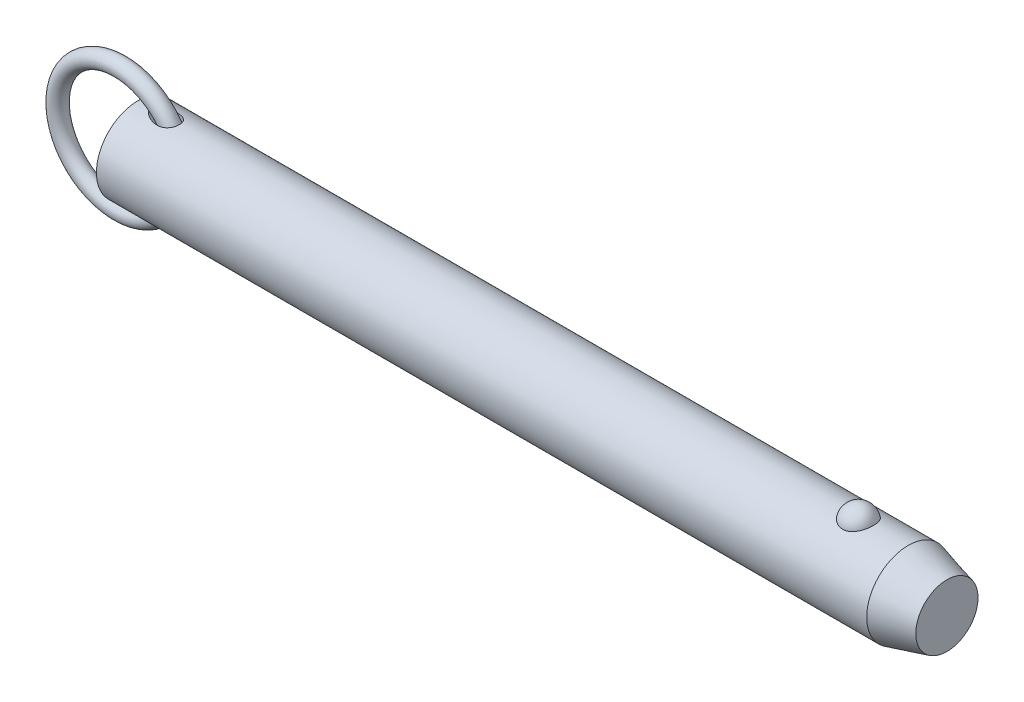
ISO-10303-21;
HEADER;
FILE_DESCRIPTION(('STEP AP214'),'2;1');
FILE_NAME('part.step','',(''),(''),'','','');
FILE_SCHEMA(('AUTOMOTIVE_DESIGN { 1 0 10303 214 1 1 1 1 }'));
ENDSEC;
DATA;
#1=APPLICATION_CONTEXT('core data for automotive mechanical design processes');
#2=APPLICATION_PROTOCOL_DEFINITION('international standard','automotive_design',2000,#1);
#3=PRODUCT_CONTEXT('',#1,'mechanical');
#4=PRODUCT('Part','Part','',(#3));
#5=PRODUCT_RELATED_PRODUCT_CATEGORY('part','',(#4));
#6=PRODUCT_DEFINITION_FORMATION('','',#4);
#7=PRODUCT_DEFINITION_CONTEXT('part definition',#1,'design');
#8=PRODUCT_DEFINITION('design','',#6,#7);
#9=PRODUCT_DEFINITION_SHAPE('','',#8);
#10=(LENGTH_UNIT() NAMED_UNIT(*) SI_UNIT(.MILLI.,.METRE.));
#11=(NAMED_UNIT(*) PLANE_ANGLE_UNIT() SI_UNIT($,.RADIAN.));
#12=(NAMED_UNIT(*) SI_UNIT($,.STERADIAN.) SOLID_ANGLE_UNIT());
#13=UNCERTAINTY_MEASURE_WITH_UNIT(LENGTH_MEASURE(1.E-05),#10,'distance_accuracy_value','');
#14=(GEOMETRIC_REPRESENTATION_CONTEXT(3) GLOBAL_UNCERTAINTY_ASSIGNED_CONTEXT((#13)) GLOBAL_UNIT_ASSIGNED_CONTEXT((#10,
#11,#12)) REPRESENTATION_CONTEXT('',''));
#15=CARTESIAN_POINT('',(0.,0.,0.));
#16=DIRECTION('',(0.,0.,1.));
#17=DIRECTION('',(1.,0.,0.));
#18=AXIS2_PLACEMENT_3D('',#15,#16,#17);
#19=CARTESIAN_POINT('',(-5.53898640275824,0.,0.));
#20=DIRECTION('',(0.,0.,1.));
#21=DIRECTION('',(1.,0.,0.));
#22=AXIS2_PLACEMENT_3D('',#19,#20,#21);
#23=TOROIDAL_SURFACE('',#22,19.05,2.54);
#24=CARTESIAN_POINT('',(16.0510135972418,0.,0.));
#25=VERTEX_POINT('',#24);
#26=VERTEX_LOOP('',#25);
#27=FACE_BOUND('',#26,.T.);
#28=ADVANCED_FACE('P0_F12',(#27),#23,.T.);
#29=CLOSED_SHELL('',(#28));
#30=MANIFOLD_SOLID_BREP('P0_B1',#29);
#31=CARTESIAN_POINT('',(0.,0.,0.));
#32=DIRECTION('',(1.,0.,0.));
#33=DIRECTION('',(0.,0.,-1.));
#34=AXIS2_PLACEMENT_3D('',#31,#32,#33);
#35=CYLINDRICAL_SURFACE('',#34,12.7);
#36=CARTESIAN_POINT('',(235.800738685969,0.,0.));
#37=DIRECTION('',(1.,0.,0.));
#38=DIRECTION('',(0.,0.,-1.));
#39=AXIS2_PLACEMENT_3D('',#36,#37,#38);
#40=CIRCLE('',#39,12.7);
#41=CARTESIAN_POINT('',(235.800738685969,0.,-12.7));
#42=VERTEX_POINT('',#41);
#43=EDGE_CURVE('P1_E89',#42,#42,#40,.T.);
#44=ORIENTED_EDGE('',*,*,#43,.F.);
#45=EDGE_LOOP('',(#44));
#46=FACE_BOUND('',#45,.T.);
#47=CARTESIAN_POINT('',(0.,0.,0.));
#48=DIRECTION('',(1.,0.,0.));
#49=DIRECTION('',(0.,0.,-1.));
#50=AXIS2_PLACEMENT_3D('',#47,#48,#49);
#51=CIRCLE('',#50,12.7);
#52=CARTESIAN_POINT('',(0.,0.,-12.7));
#53=VERTEX_POINT('',#52);
#54=EDGE_CURVE('P1_E52',#53,#53,#51,.T.);
#55=ORIENTED_EDGE('',*,*,#54,.T.);
#56=EDGE_LOOP('',(#55));
#57=FACE_BOUND('',#56,.T.);
#58=CARTESIAN_POINT('',(220.560042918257,11.7500437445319,4.81938502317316));
#59=CARTESIAN_POINT('',(220.435088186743,11.7500430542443,4.81938571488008));
#60=CARTESIAN_POINT('',(220.310144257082,11.7520975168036,4.81438658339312));
#61=CARTESIAN_POINT('',(220.061142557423,11.760253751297,4.79442904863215));
#62=CARTESIAN_POINT('',(219.937085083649,11.7663568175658,4.77946746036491));
#63=CARTESIAN_POINT('',(219.690901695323,11.7824262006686,4.73971414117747));
#64=CARTESIAN_POINT('',(219.568774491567,11.7923898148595,4.71492928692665));
#65=CARTESIAN_POINT('',(219.327187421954,11.8158938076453,4.65571340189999));
#66=CARTESIAN_POINT('',(219.20772859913,11.8294355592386,4.62127866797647));
#67=CARTESIAN_POINT('',(218.972557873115,11.8596812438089,4.54309502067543));
#68=CARTESIAN_POINT('',(218.856839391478,11.8763792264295,4.49936361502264));
#69=CARTESIAN_POINT('',(218.629653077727,11.9124878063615,4.40287235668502));
#70=CARTESIAN_POINT('',(218.518186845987,11.9318994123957,4.35010914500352));
#71=CARTESIAN_POINT('',(218.191278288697,11.9934256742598,4.1788131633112));
#72=CARTESIAN_POINT('',(217.983127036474,12.038858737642,4.04720756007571));
#73=CARTESIAN_POINT('',(217.585850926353,12.1352173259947,3.74856446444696));
#74=CARTESIAN_POINT('',(217.397443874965,12.1862630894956,3.5806182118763));
#75=CARTESIAN_POINT('',(217.050521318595,12.2875163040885,3.2160075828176));
#76=CARTESIAN_POINT('',(216.892011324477,12.3377235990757,3.01933792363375));
#77=CARTESIAN_POINT('',(216.60168878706,12.4344923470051,2.59291655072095));
#78=CARTESIAN_POINT('',(216.471376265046,12.4807925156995,2.36208286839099));
#79=CARTESIAN_POINT('',(216.249407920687,12.5623454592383,1.88070399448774));
#80=CARTESIAN_POINT('',(216.157755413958,12.5975972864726,1.63015711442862));
#81=CARTESIAN_POINT('',(216.014046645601,12.6538414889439,1.11298869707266));
#82=CARTESIAN_POINT('',(215.962499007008,12.6746503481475,0.846205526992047));
#83=CARTESIAN_POINT('',(215.901977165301,12.699153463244,0.307085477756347));
#84=CARTESIAN_POINT('',(215.893001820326,12.7028481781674,0.0347487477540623));
#85=CARTESIAN_POINT('',(215.917731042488,12.6927785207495,-0.506073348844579));
#86=CARTESIAN_POINT('',(215.951189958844,12.6791146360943,-0.774571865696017));
#87=CARTESIAN_POINT('',(216.059687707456,12.635882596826,-1.30170246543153));
#88=CARTESIAN_POINT('',(216.13472729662,12.606314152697,-1.56033436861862));
#89=CARTESIAN_POINT('',(216.325000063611,12.5342328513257,-2.06083899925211));
#90=CARTESIAN_POINT('',(216.440287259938,12.4917026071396,-2.30268867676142));
#91=CARTESIAN_POINT('',(216.708704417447,12.3981123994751,-2.76259600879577));
#92=CARTESIAN_POINT('',(216.861837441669,12.3470517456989,-2.98065173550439));
#93=CARTESIAN_POINT('',(217.203507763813,12.2416045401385,-3.38786328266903));
#94=CARTESIAN_POINT('',(217.392201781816,12.1872040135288,-3.57688418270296));
#95=CARTESIAN_POINT('',(217.800239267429,12.0814086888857,-3.91941073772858));
#96=CARTESIAN_POINT('',(218.019580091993,12.0300136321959,-4.07291945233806));
#97=CARTESIAN_POINT('',(218.478375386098,11.9373542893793,-4.33691289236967));
#98=CARTESIAN_POINT('',(218.717304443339,11.8958982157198,-4.44824125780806));
#99=CARTESIAN_POINT('',(219.21243761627,11.8268116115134,-4.62881985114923));
#100=CARTESIAN_POINT('',(219.468635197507,11.7991758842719,-4.69808589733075));
#101=CARTESIAN_POINT('',(219.977164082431,11.7622209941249,-4.78983181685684));
#102=CARTESIAN_POINT('',(220.229041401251,11.7520502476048,-4.8144902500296));
#103=CARTESIAN_POINT('',(220.733573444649,11.7485796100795,-4.82295735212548));
#104=CARTESIAN_POINT('',(220.986228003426,11.7552763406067,-4.80677420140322));
#105=CARTESIAN_POINT('',(221.476834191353,11.7842584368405,-4.73525430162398));
#106=CARTESIAN_POINT('',(221.714998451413,11.8060486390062,-4.68116061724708));
#107=CARTESIAN_POINT('',(222.178489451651,11.8622750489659,-4.53678133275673));
#108=CARTESIAN_POINT('',(222.403815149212,11.8967122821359,-4.44649279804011));
#109=CARTESIAN_POINT('',(222.840801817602,11.9754603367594,-4.22987613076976));
#110=CARTESIAN_POINT('',(223.052057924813,12.0199699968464,-4.10280539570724));
#111=CARTESIAN_POINT('',(223.450601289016,12.1138028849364,-3.81685409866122));
#112=CARTESIAN_POINT('',(223.637883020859,12.163127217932,-3.65796622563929));
#113=CARTESIAN_POINT('',(223.993350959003,12.2642343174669,-3.30364864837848));
#114=CARTESIAN_POINT('',(224.160111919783,12.316016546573,-3.10678783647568));
#115=CARTESIAN_POINT('',(224.459579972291,12.4142566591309,-2.68748409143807));
#116=CARTESIAN_POINT('',(224.592280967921,12.4607135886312,-2.46503658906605));
#117=CARTESIAN_POINT('',(224.824691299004,12.5450236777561,-1.99289519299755));
#118=CARTESIAN_POINT('',(224.923215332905,12.5825557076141,-1.74255918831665));
#119=CARTESIAN_POINT('',(225.079227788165,12.6431720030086,-1.22773734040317));
#120=CARTESIAN_POINT('',(225.136715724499,12.6662560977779,-0.963251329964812));
#121=CARTESIAN_POINT('',(225.209544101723,12.6956486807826,-0.427355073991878));
#122=CARTESIAN_POINT('',(225.224837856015,12.7019385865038,-0.155937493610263));
#123=CARTESIAN_POINT('',(225.212779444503,12.6970201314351,0.385928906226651));
#124=CARTESIAN_POINT('',(225.18542805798,12.6858120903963,0.656377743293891));
#125=CARTESIAN_POINT('',(225.113060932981,12.6568455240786,1.05454017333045));
#126=CARTESIAN_POINT('',(225.083796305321,12.6451962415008,1.18577850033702));
#127=CARTESIAN_POINT('',(225.015022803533,12.6181819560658,1.44513808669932));
#128=CARTESIAN_POINT('',(224.975517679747,12.6028183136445,1.57326046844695));
#129=CARTESIAN_POINT('',(224.886439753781,12.5687547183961,1.82554978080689));
#130=CARTESIAN_POINT('',(224.836862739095,12.5500533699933,1.94971503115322));
#131=CARTESIAN_POINT('',(224.72792115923,12.5098093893,2.19314370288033));
#132=CARTESIAN_POINT('',(224.668560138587,12.4882677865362,2.31240887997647));
#133=CARTESIAN_POINT('',(224.53997128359,12.4427679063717,2.5459303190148));
#134=CARTESIAN_POINT('',(224.470688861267,12.4187964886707,2.66015396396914));
#135=CARTESIAN_POINT('',(224.322903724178,12.3691892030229,2.882026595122));
#136=CARTESIAN_POINT('',(224.244404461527,12.3435539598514,2.98967802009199));
#137=CARTESIAN_POINT('',(224.078550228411,12.2912955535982,3.1977438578));
#138=CARTESIAN_POINT('',(223.991191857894,12.2646720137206,3.298155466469));
#139=CARTESIAN_POINT('',(223.808161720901,12.2111945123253,3.49095035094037));
#140=CARTESIAN_POINT('',(223.712493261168,12.1843406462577,3.58333679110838));
#141=CARTESIAN_POINT('',(223.513627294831,12.1312249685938,3.75922876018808));
#142=CARTESIAN_POINT('',(223.410450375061,12.104961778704,3.84275713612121));
#143=CARTESIAN_POINT('',(223.19701336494,12.0537284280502,4.00056406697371));
#144=CARTESIAN_POINT('',(223.086756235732,12.028757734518,4.07484645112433));
#145=CARTESIAN_POINT('',(222.859755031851,11.9808306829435,4.21367959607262));
#146=CARTESIAN_POINT('',(222.743006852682,11.9578756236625,4.27822410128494));
#147=CARTESIAN_POINT('',(222.50394258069,11.9147184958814,4.39698483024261));
#148=CARTESIAN_POINT('',(222.381628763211,11.894515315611,4.45120522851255));
#149=CARTESIAN_POINT('',(222.122952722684,11.8561129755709,4.55255353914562));
#150=CARTESIAN_POINT('',(221.986223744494,11.8381764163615,4.59884858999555));
#151=CARTESIAN_POINT('',(221.708608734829,11.8069093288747,4.67853897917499));
#152=CARTESIAN_POINT('',(221.567724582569,11.7935767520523,4.71194005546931));
#153=CARTESIAN_POINT('',(221.28309446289,11.7720277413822,4.7655218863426));
#154=CARTESIAN_POINT('',(221.139348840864,11.7638106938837,4.7857042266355));
#155=CARTESIAN_POINT('',(220.850411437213,11.7528195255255,4.81263433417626));
#156=CARTESIAN_POINT('',(220.705219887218,11.7500445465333,4.81938421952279));
#157=CARTESIAN_POINT('',(220.560042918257,11.7500437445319,4.81938502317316));
#158=B_SPLINE_CURVE_WITH_KNOTS('',3,(#58,#59,#60,#61,#62,#63,#64,#65,#66,#67,#68,#69,#70,#71,
#72,#73,#74,#75,#76,#77,#78,#79,#80,#81,#82,#83,#84,#85,#86,#87,#88,#89,#90,#91,#92,#93,#94,#95,
#96,#97,#98,#99,#100,#101,#102,#103,#104,#105,#106,#107,#108,#109,#110,#111,#112,#113,#114,#115,
#116,#117,#118,#119,#120,#121,#122,#123,#124,#125,#126,#127,#128,#129,#130,#131,#132,#133,#134,
#135,#136,#137,#138,#139,#140,#141,#142,#143,#144,#145,#146,#147,#148,#149,#150,#151,#152,#153,
#154,#155,#156,#157),.UNSPECIFIED.,.T.,.F.,(4,2,2,2,2,2,2,2,2,2,2,2,2,2,2,2,2,2,2,2,2,2,2,2,2,2,
2,2,2,2,2,2,2,2,2,2,2,2,2,2,2,2,2,2,2,2,2,2,2,4),(0.,0.374729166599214,0.749578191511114,
1.12416526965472,1.49889629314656,1.87292776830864,2.24709865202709,2.99481328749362,
3.76399449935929,4.53331735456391,5.33683915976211,6.14042986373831,6.95405296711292,
7.76765424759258,8.57656703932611,9.38549455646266,10.1955119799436,11.0055949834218,
11.8193353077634,12.6330054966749,13.4294141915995,14.2255231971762,14.9815786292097,
15.7374826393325,16.4696948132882,17.2019663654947,17.950197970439,18.6986017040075,
19.484470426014,20.2704797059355,21.0815215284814,21.8925729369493,22.7045213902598,
23.5164550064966,23.9209608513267,24.3253187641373,24.7298461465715,25.1342272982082,
25.5409255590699,25.9474719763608,26.3541750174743,26.760716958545,27.1661834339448,
27.5714814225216,27.9770386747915,28.382431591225,28.8181206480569,29.2536155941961,
29.6890582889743,30.1244323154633),.UNSPECIFIED.);
#159=CARTESIAN_POINT('',(220.560042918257,11.7500437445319,4.81938502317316));
#160=VERTEX_POINT('',#159);
#161=EDGE_CURVE('P1_E80',#160,#160,#158,.T.);
#162=ORIENTED_EDGE('',*,*,#161,.T.);
#163=EDGE_LOOP('',(#162));
#164=FACE_BOUND('',#163,.T.);
#165=CARTESIAN_POINT('',(-5.53898640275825,0.,0.));
#166=DIRECTION('',(0.796400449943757,-0.604769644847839,0.));
#167=DIRECTION('',(0.604769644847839,0.796400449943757,0.));
#168=AXIS2_PLACEMENT_3D('',#165,#166,#167);
#169=ELLIPSE('',#168,15.9467514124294,12.7);
#170=CARTESIAN_POINT('',(4.0948214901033,12.6864319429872,0.586893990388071));
#171=VERTEX_POINT('',#170);
#172=CARTESIAN_POINT('',(4.0948214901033,12.6864319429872,-0.586893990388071));
#173=VERTEX_POINT('',#172);
#174=EDGE_CURVE('P1_E47',#171,#173,#169,.F.);
#175=ORIENTED_EDGE('',*,*,#174,.T.);
#176=CARTESIAN_POINT('',(4.06153170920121,12.6905758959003,-0.48916605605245));
#177=CARTESIAN_POINT('',(4.08111374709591,12.6881366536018,-0.552489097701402));
#178=CARTESIAN_POINT('',(4.10417851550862,12.6852663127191,-0.614604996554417));
#179=CARTESIAN_POINT('',(4.15628434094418,12.6787965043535,-0.736067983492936));
#180=CARTESIAN_POINT('',(4.18531032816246,12.6751988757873,-0.795421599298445));
#181=CARTESIAN_POINT('',(4.27911159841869,12.6636052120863,-0.967590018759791));
#182=CARTESIAN_POINT('',(4.35123408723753,12.654730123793,-1.07635920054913));
#183=CARTESIAN_POINT('',(4.49106800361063,12.6376715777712,-1.25922957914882));
#184=CARTESIAN_POINT('',(4.55601066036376,12.6297947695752,-1.33556751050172));
#185=CARTESIAN_POINT('',(4.69223626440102,12.6134116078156,-1.4823274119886));
#186=CARTESIAN_POINT('',(4.76352147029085,12.6049050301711,-1.55274725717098));
#187=CARTESIAN_POINT('',(4.91163946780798,12.587417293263,-1.68868704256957));
#188=CARTESIAN_POINT('',(4.98851399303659,12.5784327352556,-1.75416062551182));
#189=CARTESIAN_POINT('',(5.14630057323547,12.560235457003,-1.88003275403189));
#190=CARTESIAN_POINT('',(5.2272139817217,12.5510226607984,-1.94042957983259));
#191=CARTESIAN_POINT('',(5.45368877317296,12.5256514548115,-2.09966332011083));
#192=CARTESIAN_POINT('',(5.60261616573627,12.5094182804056,-2.19371988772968));
#193=CARTESIAN_POINT('',(5.90795545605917,12.4774211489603,-2.36893890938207));
#194=CARTESIAN_POINT('',(6.06437232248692,12.4616575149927,-2.45009264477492));
#195=CARTESIAN_POINT('',(6.38306132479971,12.431227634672,-2.60008249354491));
#196=CARTESIAN_POINT('',(6.54533237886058,12.4165611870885,-2.6689208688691));
#197=CARTESIAN_POINT('',(6.87462618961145,12.3889351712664,-2.79435199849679));
#198=CARTESIAN_POINT('',(7.04164773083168,12.3759751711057,-2.85094785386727));
#199=CARTESIAN_POINT('',(7.38726647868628,12.3518460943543,-2.95377962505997));
#200=CARTESIAN_POINT('',(7.56604577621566,12.3407843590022,-2.99943209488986));
#201=CARTESIAN_POINT('',(7.92698692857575,12.3219309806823,-3.07596683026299));
#202=CARTESIAN_POINT('',(8.10914972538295,12.314140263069,-3.10684491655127));
#203=CARTESIAN_POINT('',(8.47511457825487,12.3025918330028,-3.15226850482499));
#204=CARTESIAN_POINT('',(8.65890979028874,12.2988216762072,-3.16686440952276));
#205=CARTESIAN_POINT('',(9.02696087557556,12.2959421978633,-3.17802250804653));
#206=CARTESIAN_POINT('',(9.2112162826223,12.2968292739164,-3.17459864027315));
#207=CARTESIAN_POINT('',(9.61636263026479,12.3045198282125,-3.14471110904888));
#208=CARTESIAN_POINT('',(9.8369555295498,12.3125080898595,-3.11363232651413));
#209=CARTESIAN_POINT('',(10.1619126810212,12.3303028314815,-3.04206574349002));
#210=CARTESIAN_POINT('',(10.2692747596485,12.3372061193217,-3.01403983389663));
#211=CARTESIAN_POINT('',(10.4811758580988,12.3528538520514,-2.94925947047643));
#212=CARTESIAN_POINT('',(10.5857162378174,12.361597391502,-2.91250930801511));
#213=CARTESIAN_POINT('',(10.792132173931,12.3808585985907,-2.82951748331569));
#214=CARTESIAN_POINT('',(10.8939665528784,12.3913944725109,-2.78317723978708));
#215=CARTESIAN_POINT('',(11.092611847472,12.4138762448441,-2.68112002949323));
#216=CARTESIAN_POINT('',(11.1894254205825,12.4258213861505,-2.62540809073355));
#217=CARTESIAN_POINT('',(11.3768740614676,12.4507225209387,-2.50465655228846));
#218=CARTESIAN_POINT('',(11.4675115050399,12.4636781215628,-2.43962056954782));
#219=CARTESIAN_POINT('',(11.6414572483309,12.4901070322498,-2.30048560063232));
#220=CARTESIAN_POINT('',(11.7247669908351,12.5035802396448,-2.22638840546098));
#221=CARTESIAN_POINT('',(11.8713131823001,12.5285000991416,-2.08117367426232));
#222=CARTESIAN_POINT('',(11.9357009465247,12.5399538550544,-2.01121596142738));
#223=CARTESIAN_POINT('',(12.0576805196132,12.5624496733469,-1.86555293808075));
#224=CARTESIAN_POINT('',(12.1152732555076,12.5734917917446,-1.78984841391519));
#225=CARTESIAN_POINT('',(12.223073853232,12.5947858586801,-1.63327883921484));
#226=CARTESIAN_POINT('',(12.2732844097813,12.6050380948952,-1.55241568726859));
#227=CARTESIAN_POINT('',(12.3658430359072,12.6243983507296,-1.38621267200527));
#228=CARTESIAN_POINT('',(12.4081916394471,12.6335064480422,-1.30087311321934));
#229=CARTESIAN_POINT('',(12.5150098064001,12.6569076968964,-1.05702619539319));
#230=CARTESIAN_POINT('',(12.5703399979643,12.6695746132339,-0.894232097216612));
#231=CARTESIAN_POINT('',(12.6526225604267,12.6886816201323,-0.561391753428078));
#232=CARTESIAN_POINT('',(12.6795825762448,12.6951233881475,-0.391347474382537));
#233=CARTESIAN_POINT('',(12.7041016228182,12.7009766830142,-0.0537636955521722));
#234=CARTESIAN_POINT('',(12.7024538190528,12.7005778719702,0.113714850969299));
#235=CARTESIAN_POINT('',(12.6717240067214,12.6932548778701,0.445979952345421));
#236=CARTESIAN_POINT('',(12.6426435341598,12.6863310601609,0.610766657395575));
#237=CARTESIAN_POINT('',(12.5579769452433,12.6667465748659,0.932429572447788));
#238=CARTESIAN_POINT('',(12.5024793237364,12.6541050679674,1.08933027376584));
#239=CARTESIAN_POINT('',(12.3665691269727,12.6244558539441,1.39146752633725));
#240=CARTESIAN_POINT('',(12.2861577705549,12.6074483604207,1.53670464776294));
#241=CARTESIAN_POINT('',(12.1018203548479,12.5706804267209,1.81319588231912));
#242=CARTESIAN_POINT('',(11.9976588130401,12.5508932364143,1.94428915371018));
#243=CARTESIAN_POINT('',(11.7695265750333,12.5107540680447,2.18776051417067));
#244=CARTESIAN_POINT('',(11.6455540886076,12.4904020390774,2.30013691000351));
#245=CARTESIAN_POINT('',(11.3759347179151,12.4502278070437,2.50870972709));
#246=CARTESIAN_POINT('',(11.2295880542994,12.4304654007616,2.60400962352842));
#247=CARTESIAN_POINT('',(10.9239803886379,12.3941696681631,2.77162929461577));
#248=CARTESIAN_POINT('',(10.7647152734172,12.3776373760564,2.84394171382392));
#249=CARTESIAN_POINT('',(10.4192039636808,12.3473062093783,2.97303525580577));
#250=CARTESIAN_POINT('',(10.2319332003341,12.3340204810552,3.027171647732));
#251=CARTESIAN_POINT('',(9.85152982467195,12.3134301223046,3.10986173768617));
#252=CARTESIAN_POINT('',(9.65839336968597,12.3061295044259,3.13839827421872));
#253=CARTESIAN_POINT('',(9.31022514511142,12.2982822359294,3.16897517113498));
#254=CARTESIAN_POINT('',(9.15555718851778,12.2966525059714,3.17526894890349));
#255=CARTESIAN_POINT('',(8.8461894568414,12.2967963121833,3.17471335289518));
#256=CARTESIAN_POINT('',(8.69148970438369,12.2985715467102,3.16785742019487));
#257=CARTESIAN_POINT('',(8.38280471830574,12.3051648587,3.14214692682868));
#258=CARTESIAN_POINT('',(8.22882218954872,12.3099904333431,3.12326280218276));
#259=CARTESIAN_POINT('',(7.92276070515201,12.3222644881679,3.07448013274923));
#260=CARTESIAN_POINT('',(7.77068148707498,12.3297126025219,3.04458312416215));
#261=CARTESIAN_POINT('',(7.46452663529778,12.3470493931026,2.97350781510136));
#262=CARTESIAN_POINT('',(7.31052714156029,12.3570043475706,2.93201910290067));
#263=CARTESIAN_POINT('',(7.00579083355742,12.3787609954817,2.83876185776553));
#264=CARTESIAN_POINT('',(6.85505451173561,12.3905629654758,2.7869917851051));
#265=CARTESIAN_POINT('',(6.55781208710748,12.415528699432,2.67357744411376));
#266=CARTESIAN_POINT('',(6.41129783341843,12.4286895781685,2.61195394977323));
#267=CARTESIAN_POINT('',(6.12302950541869,12.4559398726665,2.47874512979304));
#268=CARTESIAN_POINT('',(5.98127390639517,12.4700289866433,2.40716303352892));
#269=CARTESIAN_POINT('',(5.67073126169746,12.5020754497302,2.2355042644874));
#270=CARTESIAN_POINT('',(5.50343839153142,12.5201625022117,2.13268685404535));
#271=CARTESIAN_POINT('',(5.26147616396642,12.5471537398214,1.96522579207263));
#272=CARTESIAN_POINT('',(5.18224299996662,12.5561365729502,1.90713440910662));
#273=CARTESIAN_POINT('',(5.0274647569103,12.573912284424,1.78618989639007));
#274=CARTESIAN_POINT('',(4.95191912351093,12.5827051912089,1.72333748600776));
#275=CARTESIAN_POINT('',(4.81787163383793,12.598469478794,1.60360864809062));
#276=CARTESIAN_POINT('',(4.75865966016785,12.6054958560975,1.54753994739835));
#277=CARTESIAN_POINT('',(4.64406285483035,12.6191906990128,1.43158546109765));
#278=CARTESIAN_POINT('',(4.58867926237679,12.6258590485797,1.37169845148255));
#279=CARTESIAN_POINT('',(4.43014912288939,12.6450546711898,1.18656670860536));
#280=CARTESIAN_POINT('',(4.33372726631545,12.6568788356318,1.05507993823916));
#281=CARTESIAN_POINT('',(4.21252055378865,12.6718304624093,0.848052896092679));
#282=CARTESIAN_POINT('',(4.17660155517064,12.6762773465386,0.779100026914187));
#283=CARTESIAN_POINT('',(4.11264979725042,12.6842122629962,0.63708048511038));
#284=CARTESIAN_POINT('',(4.08466792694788,12.6876941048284,0.56399071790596));
#285=CARTESIAN_POINT('',(4.0615317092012,12.6905758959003,0.489166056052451));
#286=B_SPLINE_CURVE_WITH_KNOTS('',3,(#176,#177,#178,#179,#180,#181,#182,#183,#184,#185,#186,
#187,#188,#189,#190,#191,#192,#193,#194,#195,#196,#197,#198,#199,#200,#201,#202,#203,#204,#205,
#206,#207,#208,#209,#210,#211,#212,#213,#214,#215,#216,#217,#218,#219,#220,#221,#222,#223,#224,
#225,#226,#227,#228,#229,#230,#231,#232,#233,#234,#235,#236,#237,#238,#239,#240,#241,#242,#243,
#244,#245,#246,#247,#248,#249,#250,#251,#252,#253,#254,#255,#256,#257,#258,#259,#260,#261,#262,
#263,#264,#265,#266,#267,#268,#269,#270,#271,#272,#273,#274,#275,#276,#277,#278,#279,#280,#281,
#282,#283,#284,#285),.UNSPECIFIED.,.F.,.F.,(4,2,2,2,2,2,2,2,2,2,2,2,2,2,2,2,2,2,2,2,2,2,2,2,2,2,
2,2,2,2,2,2,2,2,2,2,2,2,2,2,2,2,2,2,2,2,2,2,2,2,2,2,2,2,4),(0.,0.198708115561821,
0.39691995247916,0.787580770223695,1.08882492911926,1.39017679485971,1.69407136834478,
1.9980684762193,2.52793143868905,3.05815092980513,3.58827293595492,4.11826050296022,
4.67218806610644,5.22627222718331,5.77863637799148,6.33057333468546,6.99657211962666,
7.3297741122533,7.66281254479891,7.99946156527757,8.33593054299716,8.67226935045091,
9.00854178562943,9.29544181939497,9.58230266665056,9.86905853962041,10.155794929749,
10.670233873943,11.184534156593,11.6845985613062,12.1846349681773,12.6830079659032,
13.1813565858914,13.6848795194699,14.1884479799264,14.713533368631,15.2387866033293,
15.8228373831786,16.4072794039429,16.8710810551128,17.3351141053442,17.8002921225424,
18.2654052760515,18.7444169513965,19.2235004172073,19.7015868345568,20.1795185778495,
20.7699825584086,21.0658110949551,21.361595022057,21.6069574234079,21.8523988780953,
22.3397467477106,22.5729183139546,22.8075527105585),.UNSPECIFIED.);
#287=EDGE_CURVE('P1_E51',#173,#171,#286,.T.);
#288=ORIENTED_EDGE('',*,*,#287,.T.);
#289=EDGE_LOOP('',(#175,#288));
#290=FACE_BOUND('',#289,.T.);
#291=CARTESIAN_POINT('',(-5.53898640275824,0.,0.));
#292=DIRECTION('',(-0.796400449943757,-0.604769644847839,0.));
#293=DIRECTION('',(0.604769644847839,-0.796400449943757,0.));
#294=AXIS2_PLACEMENT_3D('',#291,#292,#293);
#295=ELLIPSE('',#294,15.9467514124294,12.7);
#296=CARTESIAN_POINT('',(4.09482149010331,-12.6864319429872,0.586893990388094));
#297=VERTEX_POINT('',#296);
#298=CARTESIAN_POINT('',(4.09482149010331,-12.6864319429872,-0.586893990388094));
#299=VERTEX_POINT('',#298);
#300=EDGE_CURVE('P1_E28',#297,#299,#295,.F.);
#301=ORIENTED_EDGE('',*,*,#300,.F.);
#302=CARTESIAN_POINT('',(4.06153170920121,-12.6905758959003,0.489166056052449));
#303=CARTESIAN_POINT('',(4.08111374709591,-12.6881366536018,0.552489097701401));
#304=CARTESIAN_POINT('',(4.10417851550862,-12.6852663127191,0.614604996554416));
#305=CARTESIAN_POINT('',(4.15628434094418,-12.6787965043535,0.736067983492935));
#306=CARTESIAN_POINT('',(4.18531032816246,-12.6751988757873,0.795421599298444));
#307=CARTESIAN_POINT('',(4.27911159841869,-12.6636052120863,0.967590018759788));
#308=CARTESIAN_POINT('',(4.35123408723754,-12.654730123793,1.07635920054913));
#309=CARTESIAN_POINT('',(4.49106800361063,-12.6376715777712,1.25922957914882));
#310=CARTESIAN_POINT('',(4.55601066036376,-12.6297947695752,1.33556751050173));
#311=CARTESIAN_POINT('',(4.69223626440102,-12.6134116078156,1.4823274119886));
#312=CARTESIAN_POINT('',(4.76352147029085,-12.6049050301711,1.55274725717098));
#313=CARTESIAN_POINT('',(4.91163946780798,-12.587417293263,1.68868704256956));
#314=CARTESIAN_POINT('',(4.98851399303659,-12.5784327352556,1.75416062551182));
#315=CARTESIAN_POINT('',(5.14630057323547,-12.560235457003,1.88003275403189));
#316=CARTESIAN_POINT('',(5.2272139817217,-12.5510226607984,1.94042957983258));
#317=CARTESIAN_POINT('',(5.45368877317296,-12.5256514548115,2.09966332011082));
#318=CARTESIAN_POINT('',(5.60261616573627,-12.5094182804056,2.19371988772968));
#319=CARTESIAN_POINT('',(5.90795545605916,-12.4774211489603,2.36893890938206));
#320=CARTESIAN_POINT('',(6.06437232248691,-12.4616575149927,2.45009264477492));
#321=CARTESIAN_POINT('',(6.3830613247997,-12.431227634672,2.6000824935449));
#322=CARTESIAN_POINT('',(6.54533237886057,-12.4165611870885,2.66892086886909));
#323=CARTESIAN_POINT('',(6.87462618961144,-12.3889351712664,2.79435199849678));
#324=CARTESIAN_POINT('',(7.04164773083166,-12.3759751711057,2.85094785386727));
#325=CARTESIAN_POINT('',(7.38726647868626,-12.3518460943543,2.95377962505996));
#326=CARTESIAN_POINT('',(7.56604577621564,-12.3407843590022,2.99943209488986));
#327=CARTESIAN_POINT('',(7.92698692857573,-12.3219309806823,3.07596683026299));
#328=CARTESIAN_POINT('',(8.10914972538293,-12.314140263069,3.10684491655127));
#329=CARTESIAN_POINT('',(8.47511457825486,-12.3025918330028,3.15226850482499));
#330=CARTESIAN_POINT('',(8.65890979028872,-12.2988216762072,3.16686440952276));
#331=CARTESIAN_POINT('',(9.02696087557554,-12.2959421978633,3.17802250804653));
#332=CARTESIAN_POINT('',(9.21121628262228,-12.2968292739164,3.17459864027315));
#333=CARTESIAN_POINT('',(9.61636263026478,-12.3045198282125,3.14471110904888));
#334=CARTESIAN_POINT('',(9.83695552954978,-12.3125080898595,3.11363232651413));
#335=CARTESIAN_POINT('',(10.1619126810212,-12.3303028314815,3.04206574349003));
#336=CARTESIAN_POINT('',(10.2692747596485,-12.3372061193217,3.01403983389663));
#337=CARTESIAN_POINT('',(10.4811758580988,-12.3528538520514,2.94925947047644));
#338=CARTESIAN_POINT('',(10.5857162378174,-12.361597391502,2.91250930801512));
#339=CARTESIAN_POINT('',(10.792132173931,-12.3808585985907,2.8295174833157));
#340=CARTESIAN_POINT('',(10.8939665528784,-12.3913944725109,2.78317723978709));
#341=CARTESIAN_POINT('',(11.092611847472,-12.4138762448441,2.68112002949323));
#342=CARTESIAN_POINT('',(11.1894254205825,-12.4258213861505,2.62540809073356));
#343=CARTESIAN_POINT('',(11.3768740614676,-12.4507225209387,2.50465655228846));
#344=CARTESIAN_POINT('',(11.4675115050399,-12.4636781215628,2.43962056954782));
#345=CARTESIAN_POINT('',(11.6414572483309,-12.4901070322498,2.30048560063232));
#346=CARTESIAN_POINT('',(11.7247669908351,-12.5035802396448,2.22638840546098));
#347=CARTESIAN_POINT('',(11.8713131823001,-12.5285000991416,2.08117367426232));
#348=CARTESIAN_POINT('',(11.9357009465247,-12.5399538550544,2.01121596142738));
#349=CARTESIAN_POINT('',(12.0576805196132,-12.5624496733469,1.86555293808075));
#350=CARTESIAN_POINT('',(12.1152732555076,-12.5734917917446,1.78984841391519));
#351=CARTESIAN_POINT('',(12.223073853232,-12.5947858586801,1.63327883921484));
#352=CARTESIAN_POINT('',(12.2732844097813,-12.6050380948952,1.55241568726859));
#353=CARTESIAN_POINT('',(12.3658430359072,-12.6243983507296,1.38621267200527));
#354=CARTESIAN_POINT('',(12.4081916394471,-12.6335064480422,1.30087311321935));
#355=CARTESIAN_POINT('',(12.5150098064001,-12.6569076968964,1.05702619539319));
#356=CARTESIAN_POINT('',(12.5703399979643,-12.6695746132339,0.894232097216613));
#357=CARTESIAN_POINT('',(12.6526225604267,-12.6886816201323,0.561391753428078));
#358=CARTESIAN_POINT('',(12.6795825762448,-12.6951233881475,0.391347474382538));
#359=CARTESIAN_POINT('',(12.7041016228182,-12.7009766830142,0.0537636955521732));
#360=CARTESIAN_POINT('',(12.7024538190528,-12.7005778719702,-0.113714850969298));
#361=CARTESIAN_POINT('',(12.6717240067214,-12.6932548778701,-0.44597995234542));
#362=CARTESIAN_POINT('',(12.6426435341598,-12.6863310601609,-0.610766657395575));
#363=CARTESIAN_POINT('',(12.5579769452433,-12.6667465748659,-0.932429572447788));
#364=CARTESIAN_POINT('',(12.5024793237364,-12.6541050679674,-1.08933027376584));
#365=CARTESIAN_POINT('',(12.3665691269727,-12.6244558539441,-1.39146752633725));
#366=CARTESIAN_POINT('',(12.2861577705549,-12.6074483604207,-1.53670464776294));
#367=CARTESIAN_POINT('',(12.1018203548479,-12.5706804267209,-1.81319588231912));
#368=CARTESIAN_POINT('',(11.9976588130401,-12.5508932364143,-1.94428915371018));
#369=CARTESIAN_POINT('',(11.7695265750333,-12.5107540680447,-2.18776051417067));
#370=CARTESIAN_POINT('',(11.6455540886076,-12.4904020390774,-2.30013691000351));
#371=CARTESIAN_POINT('',(11.3759347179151,-12.4502278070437,-2.50870972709));
#372=CARTESIAN_POINT('',(11.2295880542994,-12.4304654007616,-2.60400962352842));
#373=CARTESIAN_POINT('',(10.9239803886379,-12.3941696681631,-2.77162929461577));
#374=CARTESIAN_POINT('',(10.7647152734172,-12.3776373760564,-2.84394171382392));
#375=CARTESIAN_POINT('',(10.4192039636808,-12.3473062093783,-2.97303525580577));
#376=CARTESIAN_POINT('',(10.2319332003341,-12.3340204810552,-3.027171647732));
#377=CARTESIAN_POINT('',(9.85152982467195,-12.3134301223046,-3.10986173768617));
#378=CARTESIAN_POINT('',(9.65839336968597,-12.3061295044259,-3.13839827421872));
#379=CARTESIAN_POINT('',(9.31022514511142,-12.2982822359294,-3.16897517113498));
#380=CARTESIAN_POINT('',(9.15555718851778,-12.2966525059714,-3.17526894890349));
#381=CARTESIAN_POINT('',(8.8461894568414,-12.2967963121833,-3.17471335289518));
#382=CARTESIAN_POINT('',(8.69148970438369,-12.2985715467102,-3.16785742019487));
#383=CARTESIAN_POINT('',(8.38280471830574,-12.3051648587,-3.14214692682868));
#384=CARTESIAN_POINT('',(8.22882218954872,-12.3099904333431,-3.12326280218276));
#385=CARTESIAN_POINT('',(7.92276070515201,-12.3222644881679,-3.07448013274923));
#386=CARTESIAN_POINT('',(7.77068148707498,-12.3297126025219,-3.04458312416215));
#387=CARTESIAN_POINT('',(7.46452663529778,-12.3470493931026,-2.97350781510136));
#388=CARTESIAN_POINT('',(7.31052714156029,-12.3570043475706,-2.93201910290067));
#389=CARTESIAN_POINT('',(7.00579083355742,-12.3787609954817,-2.83876185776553));
#390=CARTESIAN_POINT('',(6.85505451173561,-12.3905629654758,-2.7869917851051));
#391=CARTESIAN_POINT('',(6.55781208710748,-12.415528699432,-2.67357744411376));
#392=CARTESIAN_POINT('',(6.41129783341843,-12.4286895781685,-2.61195394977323));
#393=CARTESIAN_POINT('',(6.12302950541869,-12.4559398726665,-2.47874512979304));
#394=CARTESIAN_POINT('',(5.98127390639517,-12.4700289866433,-2.40716303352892));
#395=CARTESIAN_POINT('',(5.67073126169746,-12.5020754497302,-2.2355042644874));
#396=CARTESIAN_POINT('',(5.50343839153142,-12.5201625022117,-2.13268685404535));
#397=CARTESIAN_POINT('',(5.26147616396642,-12.5471537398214,-1.96522579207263));
#398=CARTESIAN_POINT('',(5.18224299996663,-12.5561365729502,-1.90713440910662));
#399=CARTESIAN_POINT('',(5.0274647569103,-12.573912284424,-1.78618989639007));
#400=CARTESIAN_POINT('',(4.95191912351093,-12.5827051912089,-1.72333748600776));
#401=CARTESIAN_POINT('',(4.81787163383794,-12.598469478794,-1.60360864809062));
#402=CARTESIAN_POINT('',(4.75865966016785,-12.6054958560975,-1.54753994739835));
#403=CARTESIAN_POINT('',(4.64406285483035,-12.6191906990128,-1.43158546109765));
#404=CARTESIAN_POINT('',(4.58867926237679,-12.6258590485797,-1.37169845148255));
#405=CARTESIAN_POINT('',(4.43014912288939,-12.6450546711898,-1.18656670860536));
#406=CARTESIAN_POINT('',(4.33372726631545,-12.6568788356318,-1.05507993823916));
#407=CARTESIAN_POINT('',(4.21252055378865,-12.6718304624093,-0.848052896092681));
#408=CARTESIAN_POINT('',(4.17660155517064,-12.6762773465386,-0.779100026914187));
#409=CARTESIAN_POINT('',(4.11264979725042,-12.6842122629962,-0.637080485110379));
#410=CARTESIAN_POINT('',(4.08466792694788,-12.6876941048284,-0.563990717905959));
#411=CARTESIAN_POINT('',(4.06153170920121,-12.6905758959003,-0.48916605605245));
#412=B_SPLINE_CURVE_WITH_KNOTS('',3,(#302,#303,#304,#305,#306,#307,#308,#309,#310,#311,#312,
#313,#314,#315,#316,#317,#318,#319,#320,#321,#322,#323,#324,#325,#326,#327,#328,#329,#330,#331,
#332,#333,#334,#335,#336,#337,#338,#339,#340,#341,#342,#343,#344,#345,#346,#347,#348,#349,#350,
#351,#352,#353,#354,#355,#356,#357,#358,#359,#360,#361,#362,#363,#364,#365,#366,#367,#368,#369,
#370,#371,#372,#373,#374,#375,#376,#377,#378,#379,#380,#381,#382,#383,#384,#385,#386,#387,#388,
#389,#390,#391,#392,#393,#394,#395,#396,#397,#398,#399,#400,#401,#402,#403,#404,#405,#406,#407,
#408,#409,#410,#411),.UNSPECIFIED.,.F.,.F.,(4,2,2,2,2,2,2,2,2,2,2,2,2,2,2,2,2,2,2,2,2,2,2,2,2,2,
2,2,2,2,2,2,2,2,2,2,2,2,2,2,2,2,2,2,2,2,2,2,2,2,2,2,2,2,4),(0.,0.198708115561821,
0.39691995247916,0.787580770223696,1.08882492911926,1.39017679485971,1.69407136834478,
1.9980684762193,2.52793143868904,3.05815092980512,3.58827293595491,4.11826050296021,
4.67218806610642,5.22627222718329,5.77863637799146,6.33057333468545,6.99657211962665,
7.32977411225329,7.6628125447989,7.99946156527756,8.33593054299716,8.67226935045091,
9.00854178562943,9.29544181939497,9.58230266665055,9.86905853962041,10.155794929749,
10.670233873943,11.184534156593,11.6845985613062,12.1846349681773,12.6830079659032,
13.1813565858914,13.6848795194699,14.1884479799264,14.713533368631,15.2387866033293,
15.8228373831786,16.4072794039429,16.8710810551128,17.3351141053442,17.8002921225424,
18.2654052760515,18.7444169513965,19.2235004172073,19.7015868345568,20.1795185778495,
20.7699825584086,21.0658110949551,21.361595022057,21.6069574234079,21.8523988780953,
22.3397467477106,22.5729183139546,22.8075527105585),.UNSPECIFIED.);
#413=EDGE_CURVE('P1_E10',#297,#299,#412,.T.);
#414=ORIENTED_EDGE('',*,*,#413,.T.);
#415=EDGE_LOOP('',(#301,#414));
#416=FACE_BOUND('',#415,.T.);
#417=ADVANCED_FACE('P1_F15',(#46,#57,#164,#290,#416),#35,.T.);
#418=CARTESIAN_POINT('',(0.,0.,0.));
#419=DIRECTION('',(-1.,0.,0.));
#420=DIRECTION('',(0.,0.,1.));
#421=AXIS2_PLACEMENT_3D('',#418,#419,#420);
#422=PLANE('',#421);
#423=ORIENTED_EDGE('',*,*,#54,.F.);
#424=EDGE_LOOP('',(#423));
#425=FACE_BOUND('',#424,.T.);
#426=ADVANCED_FACE('P1_F17',(#425),#422,.T.);
#427=CARTESIAN_POINT('',(247.65,0.,0.));
#428=DIRECTION('',(-1.,0.,0.));
#429=DIRECTION('',(0.,0.,1.));
#430=AXIS2_PLACEMENT_3D('',#427,#428,#429);
#431=CONICAL_SURFACE('',#430,9.52500000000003,0.26179938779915);
#432=ORIENTED_EDGE('',*,*,#43,.T.);
#433=EDGE_LOOP('',(#432));
#434=FACE_BOUND('',#433,.T.);
#435=CARTESIAN_POINT('',(247.65,0.,0.));
#436=DIRECTION('',(1.,0.,0.));
#437=DIRECTION('',(0.,0.,-1.));
#438=AXIS2_PLACEMENT_3D('',#435,#436,#437);
#439=CIRCLE('',#438,9.52500000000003);
#440=CARTESIAN_POINT('',(247.65,0.,-9.52500000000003));
#441=VERTEX_POINT('',#440);
#442=EDGE_CURVE('P1_E86',#441,#441,#439,.T.);
#443=ORIENTED_EDGE('',*,*,#442,.F.);
#444=EDGE_LOOP('',(#443));
#445=FACE_BOUND('',#444,.T.);
#446=ADVANCED_FACE('P1_F105',(#434,#445),#431,.T.);
#447=CARTESIAN_POINT('',(247.65,9.52500000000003,0.));
#448=DIRECTION('',(1.,0.,0.));
#449=DIRECTION('',(0.,0.,-1.));
#450=AXIS2_PLACEMENT_3D('',#447,#448,#449);
#451=PLANE('',#450);
#452=ORIENTED_EDGE('',*,*,#442,.T.);
#453=EDGE_LOOP('',(#452));
#454=FACE_BOUND('',#453,.T.);
#455=ADVANCED_FACE('P1_F78',(#454),#451,.T.);
#456=CARTESIAN_POINT('',(220.560042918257,11.43,0.));
#457=DIRECTION('',(-1.,0.,0.));
#458=DIRECTION('',(0.,-1.,0.));
#459=AXIS2_PLACEMENT_3D('',#456,#457,#458);
#460=SPHERICAL_SURFACE('',#459,4.82999999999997);
#461=ORIENTED_EDGE('',*,*,#161,.F.);
#462=EDGE_LOOP('',(#461));
#463=FACE_BOUND('',#462,.T.);
#464=ADVANCED_FACE('P1_F71',(#463),#460,.T.);
#465=CARTESIAN_POINT('',(-5.53898640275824,0.,0.));
#466=DIRECTION('',(0.,0.,1.));
#467=DIRECTION('',(1.,0.,0.));
#468=AXIS2_PLACEMENT_3D('',#465,#466,#467);
#469=TOROIDAL_SURFACE('',#468,19.05,3.175);
#470=CARTESIAN_POINT('',(5.9818753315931,-15.1714285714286,0.));
#471=DIRECTION('',(-0.796400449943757,-0.604769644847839,0.));
#472=DIRECTION('',(0.604769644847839,-0.796400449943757,0.));
#473=AXIS2_PLACEMENT_3D('',#470,#471,#472);
#474=CIRCLE('',#473,3.175);
#475=EDGE_CURVE('P1_E34',#297,#299,#474,.T.);
#476=ORIENTED_EDGE('',*,*,#475,.T.);
#477=ORIENTED_EDGE('',*,*,#413,.F.);
#478=EDGE_LOOP('',(#476,#477));
#479=FACE_BOUND('',#478,.T.);
#480=CARTESIAN_POINT('',(5.9818753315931,15.1714285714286,0.));
#481=DIRECTION('',(0.796400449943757,-0.604769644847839,0.));
#482=DIRECTION('',(0.604769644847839,0.796400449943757,0.));
#483=AXIS2_PLACEMENT_3D('',#480,#481,#482);
#484=CIRCLE('',#483,3.175);
#485=EDGE_CURVE('P1_E41',#171,#173,#484,.T.);
#486=ORIENTED_EDGE('',*,*,#485,.F.);
#487=ORIENTED_EDGE('',*,*,#287,.F.);
#488=EDGE_LOOP('',(#486,#487));
#489=FACE_BOUND('',#488,.T.);
#490=ADVANCED_FACE('P1_F55',(#479,#489),#469,.F.);
#491=CARTESIAN_POINT('',(5.9818753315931,-15.1714285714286,0.));
#492=DIRECTION('',(-0.796400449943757,-0.604769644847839,0.));
#493=DIRECTION('',(0.604769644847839,-0.796400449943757,0.));
#494=AXIS2_PLACEMENT_3D('',#491,#492,#493);
#495=PLANE('',#494);
#496=ORIENTED_EDGE('',*,*,#300,.T.);
#497=ORIENTED_EDGE('',*,*,#475,.F.);
#498=EDGE_LOOP('',(#496,#497));
#499=FACE_BOUND('',#498,.T.);
#500=ADVANCED_FACE('P1_F70',(#499),#495,.F.);
#501=CARTESIAN_POINT('',(5.9818753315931,15.1714285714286,0.));
#502=DIRECTION('',(0.796400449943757,-0.604769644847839,0.));
#503=DIRECTION('',(0.604769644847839,0.796400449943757,0.));
#504=AXIS2_PLACEMENT_3D('',#501,#502,#503);
#505=PLANE('',#504);
#506=ORIENTED_EDGE('',*,*,#485,.T.);
#507=ORIENTED_EDGE('',*,*,#174,.F.);
#508=EDGE_LOOP('',(#506,#507));
#509=FACE_BOUND('',#508,.T.);
#510=ADVANCED_FACE('P1_F48',(#509),#505,.T.);
#511=CLOSED_SHELL('',(#417,#426,#446,#455,#464,#490,#500,#510));
#512=MANIFOLD_SOLID_BREP('P1_B1',#511);
#513=ADVANCED_BREP_SHAPE_REPRESENTATION('',(#18,#30,#512),#14);
#514=SHAPE_DEFINITION_REPRESENTATION(#9,#513);
ENDSEC;
END-ISO-10303-21;
